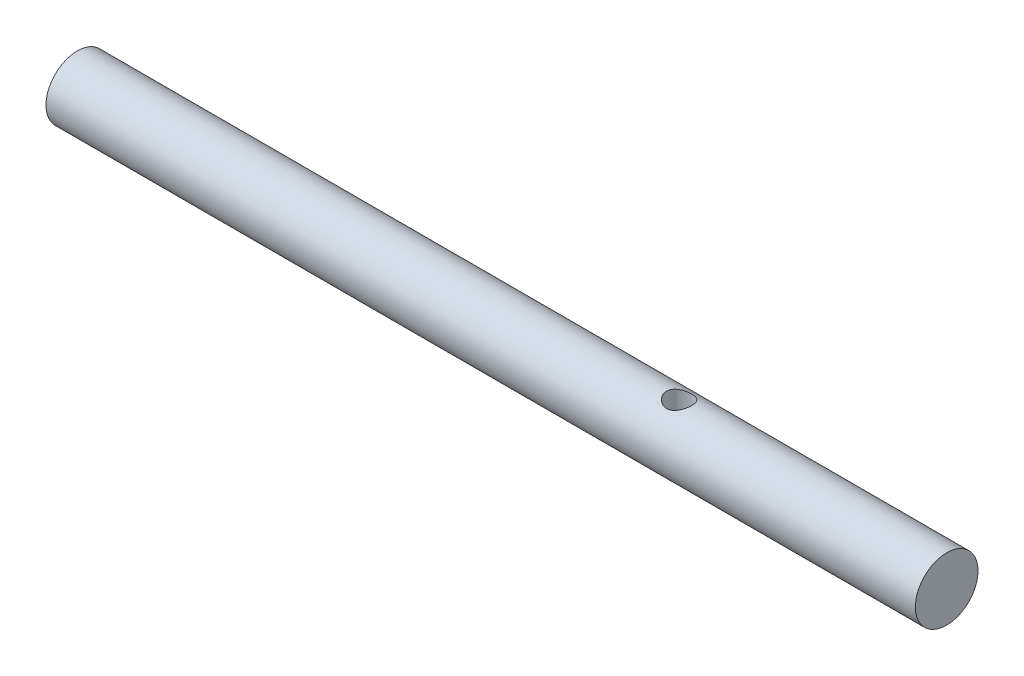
ISO-10303-21;
HEADER;
FILE_DESCRIPTION(('STEP AP214'),'2;1');
FILE_NAME('part.step','',(''),(''),'','','');
FILE_SCHEMA(('AUTOMOTIVE_DESIGN { 1 0 10303 214 1 1 1 1 }'));
ENDSEC;
DATA;
#1=APPLICATION_CONTEXT('core data for automotive mechanical design processes');
#2=APPLICATION_PROTOCOL_DEFINITION('international standard','automotive_design',2000,#1);
#3=PRODUCT_CONTEXT('',#1,'mechanical');
#4=PRODUCT('Part','Part','',(#3));
#5=PRODUCT_RELATED_PRODUCT_CATEGORY('part','',(#4));
#6=PRODUCT_DEFINITION_FORMATION('','',#4);
#7=PRODUCT_DEFINITION_CONTEXT('part definition',#1,'design');
#8=PRODUCT_DEFINITION('design','',#6,#7);
#9=PRODUCT_DEFINITION_SHAPE('','',#8);
#10=(LENGTH_UNIT() NAMED_UNIT(*) SI_UNIT(.MILLI.,.METRE.));
#11=(NAMED_UNIT(*) PLANE_ANGLE_UNIT() SI_UNIT($,.RADIAN.));
#12=(NAMED_UNIT(*) SI_UNIT($,.STERADIAN.) SOLID_ANGLE_UNIT());
#13=UNCERTAINTY_MEASURE_WITH_UNIT(LENGTH_MEASURE(1.E-05),#10,'distance_accuracy_value','');
#14=(GEOMETRIC_REPRESENTATION_CONTEXT(3) GLOBAL_UNCERTAINTY_ASSIGNED_CONTEXT((#13)) GLOBAL_UNIT_ASSIGNED_CONTEXT((#10,
#11,#12)) REPRESENTATION_CONTEXT('',''));
#15=CARTESIAN_POINT('',(0.,0.,0.));
#16=DIRECTION('',(0.,0.,1.));
#17=DIRECTION('',(1.,0.,0.));
#18=AXIS2_PLACEMENT_3D('',#15,#16,#17);
#19=CARTESIAN_POINT('',(-203.2,-47.625,23.8125));
#20=DIRECTION('',(0.,1.,0.));
#21=DIRECTION('',(-1.,0.,0.));
#22=AXIS2_PLACEMENT_3D('',#19,#20,#21);
#23=CYLINDRICAL_SURFACE('',#22,9.525);
#24=CARTESIAN_POINT('',(-212.725,0.,23.8125));
#25=CARTESIAN_POINT('',(-212.724998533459,-1.1432033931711E-06,23.5564145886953));
#26=CARTESIAN_POINT('',(-212.714658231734,-0.00414251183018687,23.3002303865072));
#27=CARTESIAN_POINT('',(-212.673390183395,-0.0206042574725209,22.789674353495));
#28=CARTESIAN_POINT('',(-212.642448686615,-0.0329300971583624,22.5353038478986));
#29=CARTESIAN_POINT('',(-212.560194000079,-0.0654721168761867,22.0297732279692));
#30=CARTESIAN_POINT('',(-212.508833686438,-0.0857065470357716,21.7786219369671));
#31=CARTESIAN_POINT('',(-212.386253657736,-0.133530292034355,21.281923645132));
#32=CARTESIAN_POINT('',(-212.315032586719,-0.161120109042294,21.0363770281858));
#33=CARTESIAN_POINT('',(-212.153675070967,-0.222835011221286,20.5533678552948));
#34=CARTESIAN_POINT('',(-212.063603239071,-0.256937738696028,20.3158808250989));
#35=CARTESIAN_POINT('',(-211.865176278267,-0.330882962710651,19.8496025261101));
#36=CARTESIAN_POINT('',(-211.756820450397,-0.370725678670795,19.6208115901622));
#37=CARTESIAN_POINT('',(-211.522735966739,-0.455155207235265,19.1733857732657));
#38=CARTESIAN_POINT('',(-211.397017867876,-0.499739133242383,18.9547448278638));
#39=CARTESIAN_POINT('',(-211.12904732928,-0.592604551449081,18.528631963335));
#40=CARTESIAN_POINT('',(-210.986788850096,-0.64088739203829,18.3211641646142));
#41=CARTESIAN_POINT('',(-210.523774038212,-0.793816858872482,17.7000752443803));
#42=CARTESIAN_POINT('',(-210.17666801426,-0.902834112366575,17.3067332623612));
#43=CARTESIAN_POINT('',(-209.422568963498,-1.12109153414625,16.5820866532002));
#44=CARTESIAN_POINT('',(-209.01554681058,-1.23033178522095,16.2508123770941));
#45=CARTESIAN_POINT('',(-208.357590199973,-1.38791360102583,15.8000102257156));
#46=CARTESIAN_POINT('',(-208.124845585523,-1.44044210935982,15.6548692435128));
#47=CARTESIAN_POINT('',(-207.646961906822,-1.5407576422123,15.3848443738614));
#48=CARTESIAN_POINT('',(-207.401827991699,-1.58854661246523,15.2599521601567));
#49=CARTESIAN_POINT('',(-206.900754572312,-1.67781345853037,15.0315055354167));
#50=CARTESIAN_POINT('',(-206.644816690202,-1.71929227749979,14.9279479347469));
#51=CARTESIAN_POINT('',(-206.123892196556,-1.79450078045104,14.7431653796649));
#52=CARTESIAN_POINT('',(-205.858906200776,-1.82823099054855,14.6619389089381));
#53=CARTESIAN_POINT('',(-205.334099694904,-1.88537089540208,14.5258771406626));
#54=CARTESIAN_POINT('',(-205.074589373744,-1.90917905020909,14.4700125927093));
#55=CARTESIAN_POINT('',(-204.551149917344,-1.94775589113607,14.3800811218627));
#56=CARTESIAN_POINT('',(-204.287220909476,-1.9625248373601,14.3460135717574));
#57=CARTESIAN_POINT('',(-203.757187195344,-1.98247741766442,14.3000923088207));
#58=CARTESIAN_POINT('',(-203.491083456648,-1.98766510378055,14.28822920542));
#59=CARTESIAN_POINT('',(-202.958812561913,-1.98827288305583,14.2868361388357));
#60=CARTESIAN_POINT('',(-202.692645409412,-1.98369343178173,14.2973051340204));
#61=CARTESIAN_POINT('',(-202.181009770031,-1.96559803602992,14.3389320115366));
#62=CARTESIAN_POINT('',(-201.935394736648,-1.95272900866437,14.368592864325));
#63=CARTESIAN_POINT('',(-201.447656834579,-1.91909850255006,14.4468212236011));
#64=CARTESIAN_POINT('',(-201.205535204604,-1.89833429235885,14.4953952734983));
#65=CARTESIAN_POINT('',(-200.726549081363,-1.84956010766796,14.6109592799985));
#66=CARTESIAN_POINT('',(-200.489683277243,-1.82155196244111,14.6779445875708));
#67=CARTESIAN_POINT('',(-200.022520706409,-1.75910371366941,14.829760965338));
#68=CARTESIAN_POINT('',(-199.792226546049,-1.72466109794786,14.9145990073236));
#69=CARTESIAN_POINT('',(-199.335100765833,-1.64957763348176,15.1032786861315));
#70=CARTESIAN_POINT('',(-199.108429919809,-1.60882682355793,15.2074657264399));
#71=CARTESIAN_POINT('',(-198.664540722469,-1.52276062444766,15.4329275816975));
#72=CARTESIAN_POINT('',(-198.447326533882,-1.47744325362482,15.5542098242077));
#73=CARTESIAN_POINT('',(-198.023549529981,-1.38344581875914,15.8130228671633));
#74=CARTESIAN_POINT('',(-197.816987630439,-1.33476546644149,15.9505550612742));
#75=CARTESIAN_POINT('',(-197.415544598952,-1.2352629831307,16.241034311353));
#76=CARTESIAN_POINT('',(-197.220664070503,-1.18444074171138,16.3939821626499));
#77=CARTESIAN_POINT('',(-196.828903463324,-1.07789720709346,16.7268913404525));
#78=CARTESIAN_POINT('',(-196.633040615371,-1.02210166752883,16.9080277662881));
#79=CARTESIAN_POINT('',(-196.257190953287,-0.910973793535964,17.2860877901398));
#80=CARTESIAN_POINT('',(-196.0771990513,-0.855641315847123,17.483006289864));
#81=CARTESIAN_POINT('',(-195.734024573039,-0.746858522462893,17.8916833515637));
#82=CARTESIAN_POINT('',(-195.57085198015,-0.693409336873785,18.1034506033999));
#83=CARTESIAN_POINT('',(-195.262604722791,-0.589866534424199,18.5404187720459));
#84=CARTESIAN_POINT('',(-195.117522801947,-0.539771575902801,18.7656142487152));
#85=CARTESIAN_POINT('',(-194.843747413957,-0.44329498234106,19.2328239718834));
#86=CARTESIAN_POINT('',(-194.715440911,-0.397007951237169,19.4750849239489));
#87=CARTESIAN_POINT('',(-194.479828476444,-0.310608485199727,19.9706886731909));
#88=CARTESIAN_POINT('',(-194.372523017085,-0.270496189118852,20.2240317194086));
#89=CARTESIAN_POINT('',(-194.179996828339,-0.197630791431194,20.7398908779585));
#90=CARTESIAN_POINT('',(-194.094767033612,-0.164874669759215,21.002403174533));
#91=CARTESIAN_POINT('',(-193.947248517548,-0.107683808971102,21.5346790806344));
#92=CARTESIAN_POINT('',(-193.884958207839,-0.083248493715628,21.8044421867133));
#93=CARTESIAN_POINT('',(-193.787018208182,-0.0446254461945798,22.3328794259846));
#94=CARTESIAN_POINT('',(-193.750009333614,-0.029916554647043,22.591264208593));
#95=CARTESIAN_POINT('',(-193.697317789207,-0.00893068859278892,23.1105377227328));
#96=CARTESIAN_POINT('',(-193.681634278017,-0.00265338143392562,23.3714263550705));
#97=CARTESIAN_POINT('',(-193.671766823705,0.00129304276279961,23.8936147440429));
#98=CARTESIAN_POINT('',(-193.677578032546,-0.0010358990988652,24.154914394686));
#99=CARTESIAN_POINT('',(-193.710624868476,-0.0142323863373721,24.6759342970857));
#100=CARTESIAN_POINT('',(-193.737860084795,-0.0250997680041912,24.9356545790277));
#101=CARTESIAN_POINT('',(-193.811744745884,-0.0543902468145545,25.4398435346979));
#102=CARTESIAN_POINT('',(-193.85746100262,-0.0724496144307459,25.6844709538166));
#103=CARTESIAN_POINT('',(-193.967732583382,-0.11562849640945,26.1688935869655));
#104=CARTESIAN_POINT('',(-194.032294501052,-0.140750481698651,26.4086870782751));
#105=CARTESIAN_POINT('',(-194.179647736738,-0.197427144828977,26.8817391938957));
#106=CARTESIAN_POINT('',(-194.262433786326,-0.228979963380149,27.1149996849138));
#107=CARTESIAN_POINT('',(-194.445587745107,-0.297779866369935,27.5737385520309));
#108=CARTESIAN_POINT('',(-194.545962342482,-0.33502911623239,27.7992139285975));
#109=CARTESIAN_POINT('',(-194.766793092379,-0.415542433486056,28.2476996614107));
#110=CARTESIAN_POINT('',(-194.887764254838,-0.458954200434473,28.4704298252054));
#111=CARTESIAN_POINT('',(-195.146682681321,-0.549852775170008,28.9050149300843));
#112=CARTESIAN_POINT('',(-195.284635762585,-0.597340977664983,29.116866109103));
#113=CARTESIAN_POINT('',(-195.576595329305,-0.695257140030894,29.5285313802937));
#114=CARTESIAN_POINT('',(-195.730604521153,-0.745685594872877,29.7283434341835));
#115=CARTESIAN_POINT('',(-196.053733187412,-0.848284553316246,30.1148772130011));
#116=CARTESIAN_POINT('',(-196.222853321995,-0.900455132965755,30.3015983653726));
#117=CARTESIAN_POINT('',(-196.586953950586,-1.0087780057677,30.6729124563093));
#118=CARTESIAN_POINT('',(-196.782905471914,-1.06496505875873,30.856544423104));
#119=CARTESIAN_POINT('',(-197.189700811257,-1.17635682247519,31.206682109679));
#120=CARTESIAN_POINT('',(-197.400539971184,-1.23156183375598,31.3731931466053));
#121=CARTESIAN_POINT('',(-197.836087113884,-1.33948140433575,31.6881796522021));
#122=CARTESIAN_POINT('',(-198.060802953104,-1.39219452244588,31.8366447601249));
#123=CARTESIAN_POINT('',(-198.5225934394,-1.49351814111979,32.1143098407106));
#124=CARTESIAN_POINT('',(-198.759662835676,-1.54213036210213,32.2435179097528));
#125=CARTESIAN_POINT('',(-199.247291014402,-1.63423250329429,32.4829230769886));
#126=CARTESIAN_POINT('',(-199.497962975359,-1.6776649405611,32.5929121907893));
#127=CARTESIAN_POINT('',(-200.008741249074,-1.7573401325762,32.7911692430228));
#128=CARTESIAN_POINT('',(-200.268843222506,-1.79358614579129,32.8794470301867));
#129=CARTESIAN_POINT('',(-200.796577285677,-1.85760502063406,33.0333839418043));
#130=CARTESIAN_POINT('',(-201.064206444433,-1.88538113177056,33.0990517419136));
#131=CARTESIAN_POINT('',(-201.604934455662,-1.93142974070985,33.2070400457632));
#132=CARTESIAN_POINT('',(-201.878032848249,-1.94970303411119,33.2493625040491));
#133=CARTESIAN_POINT('',(-202.407566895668,-1.97508613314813,33.3079433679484));
#134=CARTESIAN_POINT('',(-202.663786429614,-1.98290501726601,33.3258590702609));
#135=CARTESIAN_POINT('',(-203.176946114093,-1.98947873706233,33.3409297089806));
#136=CARTESIAN_POINT('',(-203.433886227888,-1.98823402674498,33.3380856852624));
#137=CARTESIAN_POINT('',(-203.946460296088,-1.97672469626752,33.3116724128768));
#138=CARTESIAN_POINT('',(-204.202094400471,-1.96646113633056,33.2881056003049));
#139=CARTESIAN_POINT('',(-204.710137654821,-1.93726904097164,33.2205166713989));
#140=CARTESIAN_POINT('',(-204.962546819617,-1.91834054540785,33.1764946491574));
#141=CARTESIAN_POINT('',(-205.452334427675,-1.87336959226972,33.070624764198));
#142=CARTESIAN_POINT('',(-205.68991109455,-1.84764054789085,33.0095568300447));
#143=CARTESIAN_POINT('',(-206.158985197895,-1.78953618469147,32.869539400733));
#144=CARTESIAN_POINT('',(-206.390480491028,-1.75715855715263,32.7905836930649));
#145=CARTESIAN_POINT('',(-206.845956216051,-1.68668039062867,32.6154633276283));
#146=CARTESIAN_POINT('',(-207.069936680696,-1.64857987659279,32.5192987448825));
#147=CARTESIAN_POINT('',(-207.50919971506,-1.56767777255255,32.310474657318));
#148=CARTESIAN_POINT('',(-207.724481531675,-1.52487577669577,32.1978137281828));
#149=CARTESIAN_POINT('',(-208.157305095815,-1.43310883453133,31.9498499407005));
#150=CARTESIAN_POINT('',(-208.374271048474,-1.38393136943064,31.8136202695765));
#151=CARTESIAN_POINT('',(-208.796113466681,-1.28287351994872,31.5244735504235));
#152=CARTESIAN_POINT('',(-209.000989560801,-1.23099305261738,31.3715559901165));
#153=CARTESIAN_POINT('',(-209.397642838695,-1.12585805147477,31.0499071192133));
#154=CARTESIAN_POINT('',(-209.589416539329,-1.07260315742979,30.8811716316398));
#155=CARTESIAN_POINT('',(-209.958794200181,-0.96606587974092,30.528858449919));
#156=CARTESIAN_POINT('',(-210.136398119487,-0.912783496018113,30.3452807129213));
#157=CARTESIAN_POINT('',(-210.487544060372,-0.804063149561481,29.9518242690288));
#158=CARTESIAN_POINT('',(-210.66006770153,-0.748710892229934,29.7410112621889));
#159=CARTESIAN_POINT('',(-210.986697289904,-0.640999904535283,29.304963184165));
#160=CARTESIAN_POINT('',(-211.140809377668,-0.588640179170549,29.0797329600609));
#161=CARTESIAN_POINT('',(-211.429633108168,-0.48830577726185,28.6159815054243));
#162=CARTESIAN_POINT('',(-211.564330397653,-0.440334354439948,28.3774506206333));
#163=CARTESIAN_POINT('',(-211.813043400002,-0.350176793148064,27.8888038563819));
#164=CARTESIAN_POINT('',(-211.927060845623,-0.307990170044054,27.6386889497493));
#165=CARTESIAN_POINT('',(-212.131446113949,-0.231332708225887,27.1333144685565));
#166=CARTESIAN_POINT('',(-212.222212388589,-0.196733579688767,26.8782356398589));
#167=CARTESIAN_POINT('',(-212.381888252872,-0.135271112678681,26.36042803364));
#168=CARTESIAN_POINT('',(-212.4507999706,-0.108407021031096,26.0977000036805));
#169=CARTESIAN_POINT('',(-212.565873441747,-0.0632616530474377,25.567345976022));
#170=CARTESIAN_POINT('',(-212.612096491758,-0.0449572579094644,25.2997352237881));
#171=CARTESIAN_POINT('',(-212.681516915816,-0.0173814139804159,24.761218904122));
#172=CARTESIAN_POINT('',(-212.704731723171,-0.00810312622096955,24.4903159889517));
#173=CARTESIAN_POINT('',(-212.719215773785,-0.00231307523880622,24.1512572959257));
#174=CARTESIAN_POINT('',(-212.721384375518,-0.00144604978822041,24.0835288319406));
#175=CARTESIAN_POINT('',(-212.724276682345,-0.00028936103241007,23.9480358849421));
#176=CARTESIAN_POINT('',(-212.725000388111,3.02541589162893E-07,23.8802714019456));
#177=CARTESIAN_POINT('',(-212.725,0.,23.8125));
#178=B_SPLINE_CURVE_WITH_KNOTS('',3,(#24,#25,#26,#27,#28,#29,#30,#31,#32,#33,#34,#35,#36,#37,
#38,#39,#40,#41,#42,#43,#44,#45,#46,#47,#48,#49,#50,#51,#52,#53,#54,#55,#56,#57,#58,#59,#60,#61,
#62,#63,#64,#65,#66,#67,#68,#69,#70,#71,#72,#73,#74,#75,#76,#77,#78,#79,#80,#81,#82,#83,#84,#85,
#86,#87,#88,#89,#90,#91,#92,#93,#94,#95,#96,#97,#98,#99,#100,#101,#102,#103,#104,#105,#106,#107,
#108,#109,#110,#111,#112,#113,#114,#115,#116,#117,#118,#119,#120,#121,#122,#123,#124,#125,#126,
#127,#128,#129,#130,#131,#132,#133,#134,#135,#136,#137,#138,#139,#140,#141,#142,#143,#144,#145,
#146,#147,#148,#149,#150,#151,#152,#153,#154,#155,#156,#157,#158,#159,#160,#161,#162,#163,#164,
#165,#166,#167,#168,#169,#170,#171,#172,#173,#174,#175,#176,#177),.UNSPECIFIED.,.T.,.F.,(4,2,2,
2,2,2,2,2,2,2,2,2,2,2,2,2,2,2,2,2,2,2,2,2,2,2,2,2,2,2,2,2,2,2,2,2,2,2,2,2,2,2,2,2,2,2,2,2,2,2,2,
2,2,2,2,2,2,2,2,2,2,2,2,2,2,2,2,2,2,2,2,2,2,2,2,2,4),(0.,0.768186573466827,1.53688638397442,
2.30737064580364,3.07790752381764,3.84584534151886,4.61381252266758,5.38131478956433,
6.14909818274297,7.74904234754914,9.34976685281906,10.1867091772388,11.0233064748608,
11.8597786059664,12.6961939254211,13.4947014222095,14.2931859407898,15.0913326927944,
15.8894422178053,16.6317738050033,17.3743624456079,18.1167637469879,18.8594555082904,
19.6169662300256,20.3748070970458,21.1327130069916,21.8906580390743,22.7073893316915,
23.5238578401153,24.3408082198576,25.1574298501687,25.9904266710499,26.8234422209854,
27.6561151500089,28.4887304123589,29.2720390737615,30.0553168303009,30.838417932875,
31.6215040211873,32.3691938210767,33.1171455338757,33.8648813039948,34.6129020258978,
35.3835179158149,36.1543985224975,36.9254092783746,37.6964537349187,38.5185927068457,
39.3404755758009,40.1628281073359,40.9848339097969,41.8152480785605,42.6452848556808,
43.4750027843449,44.3046512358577,45.0745614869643,45.8444331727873,46.6142143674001,
47.3839920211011,48.1231062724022,48.8624776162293,49.6018457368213,50.3412777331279,
51.1230282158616,51.9048027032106,52.6867842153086,53.468767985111,54.3016952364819,
55.1343439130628,55.96760503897,56.8007963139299,57.6185754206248,58.4362748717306,
59.2517528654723,60.0666124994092,60.2699083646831,60.4732041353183),.UNSPECIFIED.);
#179=CARTESIAN_POINT('',(-212.725,0.,23.8125));
#180=VERTEX_POINT('',#179);
#181=EDGE_CURVE('E41',#180,#180,#178,.T.);
#182=ORIENTED_EDGE('',*,*,#181,.F.);
#183=EDGE_LOOP('',(#182));
#184=FACE_BOUND('',#183,.T.);
#185=CARTESIAN_POINT('',(-212.725,-47.625,23.8125));
#186=CARTESIAN_POINT('',(-212.724998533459,-47.6249988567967,24.0685854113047));
#187=CARTESIAN_POINT('',(-212.714658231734,-47.6208574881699,24.3247696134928));
#188=CARTESIAN_POINT('',(-212.673390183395,-47.6043957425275,24.835325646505));
#189=CARTESIAN_POINT('',(-212.642448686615,-47.5920699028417,25.0896961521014));
#190=CARTESIAN_POINT('',(-212.560194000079,-47.5595278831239,25.5952267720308));
#191=CARTESIAN_POINT('',(-212.508833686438,-47.5392934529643,25.8463780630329));
#192=CARTESIAN_POINT('',(-212.386253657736,-47.4914697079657,26.343076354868));
#193=CARTESIAN_POINT('',(-212.315032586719,-47.4638798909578,26.5886229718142));
#194=CARTESIAN_POINT('',(-212.153675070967,-47.4021649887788,27.0716321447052));
#195=CARTESIAN_POINT('',(-212.063603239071,-47.368062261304,27.3091191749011));
#196=CARTESIAN_POINT('',(-211.865176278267,-47.2941170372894,27.7753974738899));
#197=CARTESIAN_POINT('',(-211.756820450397,-47.2542743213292,28.0041884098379));
#198=CARTESIAN_POINT('',(-211.522735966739,-47.1698447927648,28.4516142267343));
#199=CARTESIAN_POINT('',(-211.397017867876,-47.1252608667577,28.6702551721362));
#200=CARTESIAN_POINT('',(-211.12904732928,-47.032395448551,29.096368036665));
#201=CARTESIAN_POINT('',(-210.986788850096,-46.9841126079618,29.3038358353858));
#202=CARTESIAN_POINT('',(-210.523774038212,-46.8311831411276,29.9249247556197));
#203=CARTESIAN_POINT('',(-210.17666801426,-46.7221658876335,30.3182667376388));
#204=CARTESIAN_POINT('',(-209.422568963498,-46.5039084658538,31.0429133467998));
#205=CARTESIAN_POINT('',(-209.01554681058,-46.3946682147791,31.3741876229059));
#206=CARTESIAN_POINT('',(-208.357590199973,-46.2370863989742,31.8249897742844));
#207=CARTESIAN_POINT('',(-208.124845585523,-46.1845578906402,31.9701307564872));
#208=CARTESIAN_POINT('',(-207.646961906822,-46.0842423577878,32.2401556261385));
#209=CARTESIAN_POINT('',(-207.401827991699,-46.0364533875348,32.3650478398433));
#210=CARTESIAN_POINT('',(-206.900754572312,-45.9471865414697,32.5934944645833));
#211=CARTESIAN_POINT('',(-206.644816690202,-45.9057077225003,32.6970520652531));
#212=CARTESIAN_POINT('',(-206.123892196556,-45.830499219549,32.8818346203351));
#213=CARTESIAN_POINT('',(-205.858906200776,-45.7967690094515,32.9630610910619));
#214=CARTESIAN_POINT('',(-205.334099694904,-45.739629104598,33.0991228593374));
#215=CARTESIAN_POINT('',(-205.074589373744,-45.715820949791,33.1549874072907));
#216=CARTESIAN_POINT('',(-204.551149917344,-45.677244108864,33.2449188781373));
#217=CARTESIAN_POINT('',(-204.287220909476,-45.6624751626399,33.2789864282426));
#218=CARTESIAN_POINT('',(-203.757187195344,-45.6425225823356,33.3249076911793));
#219=CARTESIAN_POINT('',(-203.491083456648,-45.6373348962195,33.33677079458));
#220=CARTESIAN_POINT('',(-202.958812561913,-45.6367271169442,33.3381638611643));
#221=CARTESIAN_POINT('',(-202.692645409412,-45.6413065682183,33.3276948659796));
#222=CARTESIAN_POINT('',(-202.18100977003,-45.6594019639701,33.2860679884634));
#223=CARTESIAN_POINT('',(-201.935394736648,-45.6722709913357,33.256407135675));
#224=CARTESIAN_POINT('',(-201.447656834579,-45.70590149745,33.1781787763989));
#225=CARTESIAN_POINT('',(-201.205535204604,-45.7266657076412,33.1296047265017));
#226=CARTESIAN_POINT('',(-200.726549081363,-45.7754398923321,33.0140407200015));
#227=CARTESIAN_POINT('',(-200.489683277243,-45.8034480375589,32.9470554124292));
#228=CARTESIAN_POINT('',(-200.022520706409,-45.8658962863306,32.795239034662));
#229=CARTESIAN_POINT('',(-199.792226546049,-45.9003389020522,32.7104009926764));
#230=CARTESIAN_POINT('',(-199.335100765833,-45.9754223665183,32.5217213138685));
#231=CARTESIAN_POINT('',(-199.108429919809,-46.0161731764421,32.4175342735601));
#232=CARTESIAN_POINT('',(-198.664540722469,-46.1022393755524,32.1920724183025));
#233=CARTESIAN_POINT('',(-198.447326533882,-46.1475567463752,32.0707901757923));
#234=CARTESIAN_POINT('',(-198.023549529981,-46.2415541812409,31.8119771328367));
#235=CARTESIAN_POINT('',(-197.816987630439,-46.2902345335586,31.6744449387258));
#236=CARTESIAN_POINT('',(-197.415544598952,-46.3897370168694,31.383965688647));
#237=CARTESIAN_POINT('',(-197.220664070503,-46.4405592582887,31.23101783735));
#238=CARTESIAN_POINT('',(-196.828903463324,-46.5471027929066,30.8981086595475));
#239=CARTESIAN_POINT('',(-196.633040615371,-46.6028983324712,30.7169722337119));
#240=CARTESIAN_POINT('',(-196.257190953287,-46.7140262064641,30.3389122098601));
#241=CARTESIAN_POINT('',(-196.0771990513,-46.7693586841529,30.1419937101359));
#242=CARTESIAN_POINT('',(-195.734024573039,-46.8781414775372,29.7333166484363));
#243=CARTESIAN_POINT('',(-195.57085198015,-46.9315906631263,29.5215493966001));
#244=CARTESIAN_POINT('',(-195.262604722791,-47.0351334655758,29.0845812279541));
#245=CARTESIAN_POINT('',(-195.117522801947,-47.0852284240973,28.8593857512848));
#246=CARTESIAN_POINT('',(-194.843747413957,-47.181705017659,28.3921760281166));
#247=CARTESIAN_POINT('',(-194.715440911,-47.2279920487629,28.1499150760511));
#248=CARTESIAN_POINT('',(-194.479828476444,-47.3143915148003,27.654311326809));
#249=CARTESIAN_POINT('',(-194.372523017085,-47.3545038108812,27.4009682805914));
#250=CARTESIAN_POINT('',(-194.179996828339,-47.4273692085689,26.8851091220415));
#251=CARTESIAN_POINT('',(-194.094767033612,-47.4601253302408,26.622596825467));
#252=CARTESIAN_POINT('',(-193.947248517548,-47.5173161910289,26.0903209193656));
#253=CARTESIAN_POINT('',(-193.884958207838,-47.5417515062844,25.8205578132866));
#254=CARTESIAN_POINT('',(-193.787018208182,-47.5803745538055,25.2921205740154));
#255=CARTESIAN_POINT('',(-193.750009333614,-47.595083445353,25.033735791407));
#256=CARTESIAN_POINT('',(-193.697317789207,-47.6160693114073,24.5144622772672));
#257=CARTESIAN_POINT('',(-193.681634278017,-47.6223466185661,24.2535736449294));
#258=CARTESIAN_POINT('',(-193.671766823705,-47.6262930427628,23.7313852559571));
#259=CARTESIAN_POINT('',(-193.677578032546,-47.6239641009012,23.470085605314));
#260=CARTESIAN_POINT('',(-193.710624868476,-47.6107676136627,22.9490657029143));
#261=CARTESIAN_POINT('',(-193.737860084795,-47.5999002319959,22.6893454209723));
#262=CARTESIAN_POINT('',(-193.811744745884,-47.5706097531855,22.185156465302));
#263=CARTESIAN_POINT('',(-193.85746100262,-47.5525503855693,21.9405290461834));
#264=CARTESIAN_POINT('',(-193.967732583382,-47.5093715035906,21.4561064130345));
#265=CARTESIAN_POINT('',(-194.032294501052,-47.4842495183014,21.2163129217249));
#266=CARTESIAN_POINT('',(-194.179647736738,-47.4275728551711,20.7432608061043));
#267=CARTESIAN_POINT('',(-194.262433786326,-47.3960200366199,20.5100003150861));
#268=CARTESIAN_POINT('',(-194.445587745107,-47.3272201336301,20.0512614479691));
#269=CARTESIAN_POINT('',(-194.545962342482,-47.2899708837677,19.8257860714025));
#270=CARTESIAN_POINT('',(-194.766793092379,-47.209457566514,19.3773003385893));
#271=CARTESIAN_POINT('',(-194.887764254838,-47.1660457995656,19.1545701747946));
#272=CARTESIAN_POINT('',(-195.146682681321,-47.07514722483,18.7199850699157));
#273=CARTESIAN_POINT('',(-195.284635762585,-47.0276590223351,18.508133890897));
#274=CARTESIAN_POINT('',(-195.576595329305,-46.9297428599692,18.0964686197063));
#275=CARTESIAN_POINT('',(-195.730604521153,-46.8793144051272,17.8966565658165));
#276=CARTESIAN_POINT('',(-196.053733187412,-46.7767154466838,17.5101227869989));
#277=CARTESIAN_POINT('',(-196.222853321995,-46.7245448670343,17.3234016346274));
#278=CARTESIAN_POINT('',(-196.586953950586,-46.6162219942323,16.9520875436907));
#279=CARTESIAN_POINT('',(-196.782905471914,-46.5600349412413,16.768455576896));
#280=CARTESIAN_POINT('',(-197.189700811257,-46.4486431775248,16.4183178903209));
#281=CARTESIAN_POINT('',(-197.400539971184,-46.3934381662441,16.2518068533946));
#282=CARTESIAN_POINT('',(-197.836087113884,-46.2855185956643,15.9368203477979));
#283=CARTESIAN_POINT('',(-198.060802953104,-46.2328054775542,15.788355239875));
#284=CARTESIAN_POINT('',(-198.5225934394,-46.1314818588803,15.5106901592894));
#285=CARTESIAN_POINT('',(-198.759662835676,-46.0828696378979,15.3814820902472));
#286=CARTESIAN_POINT('',(-199.247291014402,-45.9907674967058,15.1420769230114));
#287=CARTESIAN_POINT('',(-199.497962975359,-45.947335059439,15.0320878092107));
#288=CARTESIAN_POINT('',(-200.008741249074,-45.8676598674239,14.8338307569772));
#289=CARTESIAN_POINT('',(-200.268843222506,-45.8314138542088,14.7455529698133));
#290=CARTESIAN_POINT('',(-200.796577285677,-45.767394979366,14.5916160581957));
#291=CARTESIAN_POINT('',(-201.064206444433,-45.7396188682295,14.5259482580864));
#292=CARTESIAN_POINT('',(-201.604934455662,-45.6935702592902,14.4179599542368));
#293=CARTESIAN_POINT('',(-201.878032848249,-45.6752969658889,14.3756374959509));
#294=CARTESIAN_POINT('',(-202.407566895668,-45.6499138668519,14.3170566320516));
#295=CARTESIAN_POINT('',(-202.663786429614,-45.642094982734,14.299140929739));
#296=CARTESIAN_POINT('',(-203.176946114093,-45.6355212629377,14.2840702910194));
#297=CARTESIAN_POINT('',(-203.433886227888,-45.6367659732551,14.2869143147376));
#298=CARTESIAN_POINT('',(-203.946460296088,-45.6482753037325,14.3133275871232));
#299=CARTESIAN_POINT('',(-204.202094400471,-45.6585388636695,14.3368943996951));
#300=CARTESIAN_POINT('',(-204.710137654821,-45.6877309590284,14.4044833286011));
#301=CARTESIAN_POINT('',(-204.962546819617,-45.7066594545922,14.4485053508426));
#302=CARTESIAN_POINT('',(-205.452334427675,-45.7516304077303,14.554375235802));
#303=CARTESIAN_POINT('',(-205.68991109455,-45.7773594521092,14.6154431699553));
#304=CARTESIAN_POINT('',(-206.158985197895,-45.8354638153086,14.755460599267));
#305=CARTESIAN_POINT('',(-206.390480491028,-45.8678414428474,14.8344163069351));
#306=CARTESIAN_POINT('',(-206.845956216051,-45.9383196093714,15.0095366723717));
#307=CARTESIAN_POINT('',(-207.069936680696,-45.9764201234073,15.1057012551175));
#308=CARTESIAN_POINT('',(-207.50919971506,-46.0573222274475,15.314525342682));
#309=CARTESIAN_POINT('',(-207.724481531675,-46.1001242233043,15.4271862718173));
#310=CARTESIAN_POINT('',(-208.157305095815,-46.1918911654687,15.6751500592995));
#311=CARTESIAN_POINT('',(-208.374271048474,-46.2410686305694,15.8113797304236));
#312=CARTESIAN_POINT('',(-208.796113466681,-46.3421264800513,16.1005264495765));
#313=CARTESIAN_POINT('',(-209.000989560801,-46.3940069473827,16.2534440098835));
#314=CARTESIAN_POINT('',(-209.397642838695,-46.4991419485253,16.5750928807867));
#315=CARTESIAN_POINT('',(-209.589416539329,-46.5523968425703,16.7438283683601));
#316=CARTESIAN_POINT('',(-209.958794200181,-46.6589341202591,17.096141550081));
#317=CARTESIAN_POINT('',(-210.136398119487,-46.7122165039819,17.2797192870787));
#318=CARTESIAN_POINT('',(-210.487544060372,-46.8209368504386,17.6731757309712));
#319=CARTESIAN_POINT('',(-210.66006770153,-46.8762891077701,17.8839887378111));
#320=CARTESIAN_POINT('',(-210.986697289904,-46.9840000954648,18.320036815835));
#321=CARTESIAN_POINT('',(-211.140809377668,-47.0363598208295,18.5452670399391));
#322=CARTESIAN_POINT('',(-211.429633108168,-47.1366942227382,19.0090184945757));
#323=CARTESIAN_POINT('',(-211.564330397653,-47.1846656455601,19.2475493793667));
#324=CARTESIAN_POINT('',(-211.813043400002,-47.274823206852,19.7361961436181));
#325=CARTESIAN_POINT('',(-211.927060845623,-47.317009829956,19.9863110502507));
#326=CARTESIAN_POINT('',(-212.131446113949,-47.3936672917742,20.4916855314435));
#327=CARTESIAN_POINT('',(-212.222212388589,-47.4282664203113,20.7467643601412));
#328=CARTESIAN_POINT('',(-212.381888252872,-47.4897288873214,21.26457196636));
#329=CARTESIAN_POINT('',(-212.4507999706,-47.516592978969,21.5272999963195));
#330=CARTESIAN_POINT('',(-212.565873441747,-47.5617383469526,22.057654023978));
#331=CARTESIAN_POINT('',(-212.612096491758,-47.5800427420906,22.3252647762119));
#332=CARTESIAN_POINT('',(-212.681516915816,-47.6076185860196,22.863781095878));
#333=CARTESIAN_POINT('',(-212.704731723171,-47.6168968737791,23.1346840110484));
#334=CARTESIAN_POINT('',(-212.719215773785,-47.6226869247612,23.4737427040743));
#335=CARTESIAN_POINT('',(-212.721384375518,-47.6235539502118,23.5414711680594));
#336=CARTESIAN_POINT('',(-212.724276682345,-47.6247106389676,23.6769641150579));
#337=CARTESIAN_POINT('',(-212.725000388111,-47.6250003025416,23.7447285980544));
#338=CARTESIAN_POINT('',(-212.725,-47.625,23.8125));
#339=B_SPLINE_CURVE_WITH_KNOTS('',3,(#185,#186,#187,#188,#189,#190,#191,#192,#193,#194,#195,
#196,#197,#198,#199,#200,#201,#202,#203,#204,#205,#206,#207,#208,#209,#210,#211,#212,#213,#214,
#215,#216,#217,#218,#219,#220,#221,#222,#223,#224,#225,#226,#227,#228,#229,#230,#231,#232,#233,
#234,#235,#236,#237,#238,#239,#240,#241,#242,#243,#244,#245,#246,#247,#248,#249,#250,#251,#252,
#253,#254,#255,#256,#257,#258,#259,#260,#261,#262,#263,#264,#265,#266,#267,#268,#269,#270,#271,
#272,#273,#274,#275,#276,#277,#278,#279,#280,#281,#282,#283,#284,#285,#286,#287,#288,#289,#290,
#291,#292,#293,#294,#295,#296,#297,#298,#299,#300,#301,#302,#303,#304,#305,#306,#307,#308,#309,
#310,#311,#312,#313,#314,#315,#316,#317,#318,#319,#320,#321,#322,#323,#324,#325,#326,#327,#328,
#329,#330,#331,#332,#333,#334,#335,#336,#337,#338),.UNSPECIFIED.,.T.,.F.,(4,2,2,2,2,2,2,2,2,2,2,
2,2,2,2,2,2,2,2,2,2,2,2,2,2,2,2,2,2,2,2,2,2,2,2,2,2,2,2,2,2,2,2,2,2,2,2,2,2,2,2,2,2,2,2,2,2,2,2,
2,2,2,2,2,2,2,2,2,2,2,2,2,2,2,2,2,4),(0.,0.768186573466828,1.53688638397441,2.30737064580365,
3.07790752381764,3.84584534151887,4.61381252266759,5.38131478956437,6.14909818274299,
7.74904234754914,9.34976685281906,10.1867091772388,11.0233064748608,11.8597786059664,
12.6961939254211,13.4947014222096,14.2931859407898,15.0913326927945,15.8894422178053,
16.6317738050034,17.374362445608,18.1167637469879,18.8594555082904,19.6169662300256,
20.3748070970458,21.1327130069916,21.8906580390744,22.7073893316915,23.5238578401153,
24.3408082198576,25.1574298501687,25.99042667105,26.8234422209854,27.6561151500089,
28.488730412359,29.2720390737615,30.0553168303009,30.838417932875,31.6215040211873,
32.3691938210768,33.1171455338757,33.8648813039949,34.6129020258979,35.3835179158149,
36.1543985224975,36.9254092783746,37.6964537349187,38.5185927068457,39.340475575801,
40.162828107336,40.9848339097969,41.8152480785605,42.6452848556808,43.4750027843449,
44.3046512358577,45.0745614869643,45.8444331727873,46.6142143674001,47.3839920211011,
48.1231062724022,48.8624776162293,49.6018457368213,50.3412777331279,51.1230282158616,
51.9048027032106,52.6867842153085,53.468767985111,54.3016952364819,55.1343439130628,
55.96760503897,56.8007963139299,57.6185754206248,58.4362748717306,59.2517528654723,
60.0666124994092,60.2699083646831,60.4732041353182),.UNSPECIFIED.);
#340=CARTESIAN_POINT('',(-212.725,-47.625,23.8125));
#341=VERTEX_POINT('',#340);
#342=EDGE_CURVE('E11',#341,#341,#339,.T.);
#343=ORIENTED_EDGE('',*,*,#342,.F.);
#344=EDGE_LOOP('',(#343));
#345=FACE_BOUND('',#344,.T.);
#346=ADVANCED_FACE('F30',(#184,#345),#23,.F.);
#347=CARTESIAN_POINT('',(-660.4,-23.8125000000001,23.8125));
#348=DIRECTION('',(1.,0.,0.));
#349=DIRECTION('',(0.,1.,0.));
#350=AXIS2_PLACEMENT_3D('',#347,#348,#349);
#351=CYLINDRICAL_SURFACE('',#350,23.8125);
#352=ORIENTED_EDGE('',*,*,#181,.T.);
#353=EDGE_LOOP('',(#352));
#354=FACE_BOUND('',#353,.T.);
#355=CARTESIAN_POINT('',(0.,-23.8125,23.8125));
#356=DIRECTION('',(1.,0.,0.));
#357=DIRECTION('',(0.,1.,0.));
#358=AXIS2_PLACEMENT_3D('',#355,#356,#357);
#359=CIRCLE('',#358,23.8125);
#360=CARTESIAN_POINT('',(0.,0.,23.8125));
#361=VERTEX_POINT('',#360);
#362=EDGE_CURVE('E49',#361,#361,#359,.T.);
#363=ORIENTED_EDGE('',*,*,#362,.F.);
#364=EDGE_LOOP('',(#363));
#365=FACE_BOUND('',#364,.T.);
#366=ORIENTED_EDGE('',*,*,#342,.T.);
#367=EDGE_LOOP('',(#366));
#368=FACE_BOUND('',#367,.T.);
#369=CARTESIAN_POINT('',(-660.4,-23.8125000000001,23.8125));
#370=DIRECTION('',(1.,0.,0.));
#371=DIRECTION('',(0.,1.,0.));
#372=AXIS2_PLACEMENT_3D('',#369,#370,#371);
#373=CIRCLE('',#372,23.8125);
#374=CARTESIAN_POINT('',(-660.4,0.,23.8125));
#375=VERTEX_POINT('',#374);
#376=EDGE_CURVE('E45',#375,#375,#373,.T.);
#377=ORIENTED_EDGE('',*,*,#376,.T.);
#378=EDGE_LOOP('',(#377));
#379=FACE_BOUND('',#378,.T.);
#380=ADVANCED_FACE('F55',(#354,#365,#368,#379),#351,.T.);
#381=CARTESIAN_POINT('',(-660.4,0.,47.625));
#382=DIRECTION('',(1.,0.,0.));
#383=DIRECTION('',(0.,1.,0.));
#384=AXIS2_PLACEMENT_3D('',#381,#382,#383);
#385=PLANE('',#384);
#386=ORIENTED_EDGE('',*,*,#376,.F.);
#387=EDGE_LOOP('',(#386));
#388=FACE_BOUND('',#387,.T.);
#389=ADVANCED_FACE('F58',(#388),#385,.F.);
#390=CARTESIAN_POINT('',(0.,0.,47.625));
#391=DIRECTION('',(-1.,0.,0.));
#392=DIRECTION('',(0.,-1.,0.));
#393=AXIS2_PLACEMENT_3D('',#390,#391,#392);
#394=PLANE('',#393);
#395=ORIENTED_EDGE('',*,*,#362,.T.);
#396=EDGE_LOOP('',(#395));
#397=FACE_BOUND('',#396,.T.);
#398=ADVANCED_FACE('F32',(#397),#394,.F.);
#399=CLOSED_SHELL('',(#346,#380,#389,#398));
#400=MANIFOLD_SOLID_BREP('B2',#399);
#401=ADVANCED_BREP_SHAPE_REPRESENTATION('',(#18,#400),#14);
#402=SHAPE_DEFINITION_REPRESENTATION(#9,#401);
ENDSEC;
END-ISO-10303-21;
